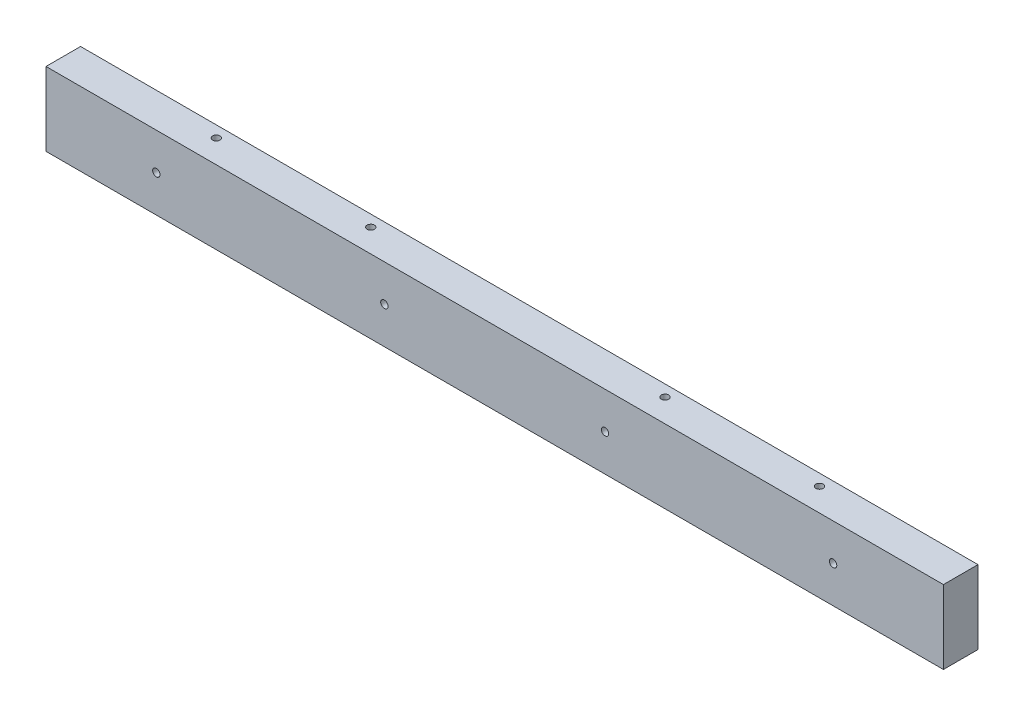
ISO-10303-21;
HEADER;
FILE_DESCRIPTION(('STEP AP214'),'2;1');
FILE_NAME('part.step','',(''),(''),'','','');
FILE_SCHEMA(('AUTOMOTIVE_DESIGN { 1 0 10303 214 1 1 1 1 }'));
ENDSEC;
DATA;
#1=APPLICATION_CONTEXT('core data for automotive mechanical design processes');
#2=APPLICATION_PROTOCOL_DEFINITION('international standard','automotive_design',2000,#1);
#3=PRODUCT_CONTEXT('',#1,'mechanical');
#4=PRODUCT('Part','Part','',(#3));
#5=PRODUCT_RELATED_PRODUCT_CATEGORY('part','',(#4));
#6=PRODUCT_DEFINITION_FORMATION('','',#4);
#7=PRODUCT_DEFINITION_CONTEXT('part definition',#1,'design');
#8=PRODUCT_DEFINITION('design','',#6,#7);
#9=PRODUCT_DEFINITION_SHAPE('','',#8);
#10=(LENGTH_UNIT() NAMED_UNIT(*) SI_UNIT(.MILLI.,.METRE.));
#11=(NAMED_UNIT(*) PLANE_ANGLE_UNIT() SI_UNIT($,.RADIAN.));
#12=(NAMED_UNIT(*) SI_UNIT($,.STERADIAN.) SOLID_ANGLE_UNIT());
#13=UNCERTAINTY_MEASURE_WITH_UNIT(LENGTH_MEASURE(1.E-05),#10,'distance_accuracy_value','');
#14=(GEOMETRIC_REPRESENTATION_CONTEXT(3) GLOBAL_UNCERTAINTY_ASSIGNED_CONTEXT((#13)) GLOBAL_UNIT_ASSIGNED_CONTEXT((#10,
#11,#12)) REPRESENTATION_CONTEXT('',''));
#15=CARTESIAN_POINT('',(0.,0.,0.));
#16=DIRECTION('',(0.,0.,1.));
#17=DIRECTION('',(1.,0.,0.));
#18=AXIS2_PLACEMENT_3D('',#15,#16,#17);
#19=CARTESIAN_POINT('',(0.,100.,0.));
#20=DIRECTION('',(1.,0.,0.));
#21=DIRECTION('',(0.,0.,-1.));
#22=AXIS2_PLACEMENT_3D('',#19,#20,#21);
#23=PLANE('',#22);
#24=DIRECTION('',(0.,0.,1.));
#25=VECTOR('',#24,1.);
#26=CARTESIAN_POINT('',(0.,0.,0.));
#27=LINE('',#26,#25);
#28=CARTESIAN_POINT('',(0.,0.,-47.));
#29=VERTEX_POINT('',#28);
#30=CARTESIAN_POINT('',(0.,0.,0.));
#31=VERTEX_POINT('',#30);
#32=EDGE_CURVE('E96',#29,#31,#27,.T.);
#33=ORIENTED_EDGE('',*,*,#32,.T.);
#34=DIRECTION('',(0.,-1.,0.));
#35=VECTOR('',#34,1.);
#36=CARTESIAN_POINT('',(0.,100.,0.));
#37=LINE('',#36,#35);
#38=CARTESIAN_POINT('',(0.,100.,0.));
#39=VERTEX_POINT('',#38);
#40=EDGE_CURVE('E11',#39,#31,#37,.T.);
#41=ORIENTED_EDGE('',*,*,#40,.F.);
#42=DIRECTION('',(0.,0.,1.));
#43=VECTOR('',#42,1.);
#44=CARTESIAN_POINT('',(0.,100.,0.));
#45=LINE('',#44,#43);
#46=CARTESIAN_POINT('',(0.,100.,-47.));
#47=VERTEX_POINT('',#46);
#48=EDGE_CURVE('E84',#47,#39,#45,.T.);
#49=ORIENTED_EDGE('',*,*,#48,.F.);
#50=DIRECTION('',(0.,-1.,0.));
#51=VECTOR('',#50,1.);
#52=CARTESIAN_POINT('',(0.,100.,-47.));
#53=LINE('',#52,#51);
#54=EDGE_CURVE('E92',#47,#29,#53,.T.);
#55=ORIENTED_EDGE('',*,*,#54,.T.);
#56=EDGE_LOOP('',(#33,#41,#49,#55));
#57=FACE_BOUND('',#56,.T.);
#58=ADVANCED_FACE('F33',(#57),#23,.F.);
#59=CARTESIAN_POINT('',(0.,100.,0.));
#60=DIRECTION('',(0.,0.,-1.));
#61=DIRECTION('',(-1.,0.,0.));
#62=AXIS2_PLACEMENT_3D('',#59,#60,#61);
#63=PLANE('',#62);
#64=CARTESIAN_POINT('',(150.,50.,0.));
#65=DIRECTION('',(0.,0.,1.));
#66=DIRECTION('',(1.,0.,0.));
#67=AXIS2_PLACEMENT_3D('',#64,#65,#66);
#68=CIRCLE('',#67,5.00000000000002);
#69=CARTESIAN_POINT('',(155.,50.,0.));
#70=VERTEX_POINT('',#69);
#71=EDGE_CURVE('E127',#70,#70,#68,.T.);
#72=ORIENTED_EDGE('',*,*,#71,.F.);
#73=EDGE_LOOP('',(#72));
#74=FACE_BOUND('',#73,.T.);
#75=CARTESIAN_POINT('',(460.,50.,0.));
#76=DIRECTION('',(0.,0.,1.));
#77=DIRECTION('',(1.,0.,0.));
#78=AXIS2_PLACEMENT_3D('',#75,#76,#77);
#79=CIRCLE('',#78,4.99999999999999);
#80=CARTESIAN_POINT('',(465.,50.,0.));
#81=VERTEX_POINT('',#80);
#82=EDGE_CURVE('E121',#81,#81,#79,.T.);
#83=ORIENTED_EDGE('',*,*,#82,.F.);
#84=EDGE_LOOP('',(#83));
#85=FACE_BOUND('',#84,.T.);
#86=CARTESIAN_POINT('',(760.,50.,0.));
#87=DIRECTION('',(0.,0.,1.));
#88=DIRECTION('',(-1.,0.,0.));
#89=AXIS2_PLACEMENT_3D('',#86,#87,#88);
#90=CIRCLE('',#89,4.99999999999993);
#91=CARTESIAN_POINT('',(755.,50.,0.));
#92=VERTEX_POINT('',#91);
#93=EDGE_CURVE('E113',#92,#92,#90,.T.);
#94=ORIENTED_EDGE('',*,*,#93,.F.);
#95=EDGE_LOOP('',(#94));
#96=FACE_BOUND('',#95,.T.);
#97=CARTESIAN_POINT('',(1070.,50.0000000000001,0.));
#98=DIRECTION('',(0.,0.,1.));
#99=DIRECTION('',(-1.,0.,0.));
#100=AXIS2_PLACEMENT_3D('',#97,#98,#99);
#101=CIRCLE('',#100,5.00000000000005);
#102=CARTESIAN_POINT('',(1065.,50.0000000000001,0.));
#103=VERTEX_POINT('',#102);
#104=EDGE_CURVE('E114',#103,#103,#101,.T.);
#105=ORIENTED_EDGE('',*,*,#104,.F.);
#106=EDGE_LOOP('',(#105));
#107=FACE_BOUND('',#106,.T.);
#108=DIRECTION('',(1.,0.,0.));
#109=VECTOR('',#108,1.);
#110=CARTESIAN_POINT('',(0.,0.,0.));
#111=LINE('',#110,#109);
#112=CARTESIAN_POINT('',(1220.,0.,0.));
#113=VERTEX_POINT('',#112);
#114=EDGE_CURVE('E88',#31,#113,#111,.T.);
#115=ORIENTED_EDGE('',*,*,#114,.T.);
#116=DIRECTION('',(0.,-1.,0.));
#117=VECTOR('',#116,1.);
#118=CARTESIAN_POINT('',(1220.,100.,0.));
#119=LINE('',#118,#117);
#120=CARTESIAN_POINT('',(1220.,100.,0.));
#121=VERTEX_POINT('',#120);
#122=EDGE_CURVE('E41',#121,#113,#119,.T.);
#123=ORIENTED_EDGE('',*,*,#122,.F.);
#124=DIRECTION('',(1.,0.,0.));
#125=VECTOR('',#124,1.);
#126=CARTESIAN_POINT('',(0.,100.,0.));
#127=LINE('',#126,#125);
#128=EDGE_CURVE('E79',#39,#121,#127,.T.);
#129=ORIENTED_EDGE('',*,*,#128,.F.);
#130=ORIENTED_EDGE('',*,*,#40,.T.);
#131=EDGE_LOOP('',(#115,#123,#129,#130));
#132=FACE_BOUND('',#131,.T.);
#133=ADVANCED_FACE('F87',(#74,#85,#96,#107,#132),#63,.F.);
#134=CARTESIAN_POINT('',(1220.,100.,0.));
#135=DIRECTION('',(-1.,0.,0.));
#136=DIRECTION('',(0.,0.,1.));
#137=AXIS2_PLACEMENT_3D('',#134,#135,#136);
#138=PLANE('',#137);
#139=DIRECTION('',(0.,0.,-1.));
#140=VECTOR('',#139,1.);
#141=CARTESIAN_POINT('',(1220.,0.,0.));
#142=LINE('',#141,#140);
#143=CARTESIAN_POINT('',(1220.,0.,-47.));
#144=VERTEX_POINT('',#143);
#145=EDGE_CURVE('E66',#113,#144,#142,.T.);
#146=ORIENTED_EDGE('',*,*,#145,.T.);
#147=DIRECTION('',(0.,-1.,0.));
#148=VECTOR('',#147,1.);
#149=CARTESIAN_POINT('',(1220.,100.,-47.));
#150=LINE('',#149,#148);
#151=CARTESIAN_POINT('',(1220.,100.,-47.));
#152=VERTEX_POINT('',#151);
#153=EDGE_CURVE('E89',#152,#144,#150,.T.);
#154=ORIENTED_EDGE('',*,*,#153,.F.);
#155=DIRECTION('',(0.,0.,-1.));
#156=VECTOR('',#155,1.);
#157=CARTESIAN_POINT('',(1220.,100.,0.));
#158=LINE('',#157,#156);
#159=EDGE_CURVE('E82',#121,#152,#158,.T.);
#160=ORIENTED_EDGE('',*,*,#159,.F.);
#161=ORIENTED_EDGE('',*,*,#122,.T.);
#162=EDGE_LOOP('',(#146,#154,#160,#161));
#163=FACE_BOUND('',#162,.T.);
#164=ADVANCED_FACE('F90',(#163),#138,.F.);
#165=CARTESIAN_POINT('',(0.,100.,-47.));
#166=DIRECTION('',(0.,0.,1.));
#167=DIRECTION('',(1.,0.,0.));
#168=AXIS2_PLACEMENT_3D('',#165,#166,#167);
#169=PLANE('',#168);
#170=CARTESIAN_POINT('',(150.,50.,-47.));
#171=DIRECTION('',(0.,0.,1.));
#172=DIRECTION('',(1.,0.,0.));
#173=AXIS2_PLACEMENT_3D('',#170,#171,#172);
#174=CIRCLE('',#173,5.00000000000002);
#175=CARTESIAN_POINT('',(155.,50.,-47.));
#176=VERTEX_POINT('',#175);
#177=EDGE_CURVE('E99',#176,#176,#174,.F.);
#178=ORIENTED_EDGE('',*,*,#177,.F.);
#179=EDGE_LOOP('',(#178));
#180=FACE_BOUND('',#179,.T.);
#181=CARTESIAN_POINT('',(460.,50.,-47.));
#182=DIRECTION('',(0.,0.,1.));
#183=DIRECTION('',(1.,0.,0.));
#184=AXIS2_PLACEMENT_3D('',#181,#182,#183);
#185=CIRCLE('',#184,4.99999999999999);
#186=CARTESIAN_POINT('',(465.,50.,-47.));
#187=VERTEX_POINT('',#186);
#188=EDGE_CURVE('E124',#187,#187,#185,.F.);
#189=ORIENTED_EDGE('',*,*,#188,.F.);
#190=EDGE_LOOP('',(#189));
#191=FACE_BOUND('',#190,.T.);
#192=CARTESIAN_POINT('',(760.,50.,-47.));
#193=DIRECTION('',(0.,0.,1.));
#194=DIRECTION('',(1.,0.,0.));
#195=AXIS2_PLACEMENT_3D('',#192,#193,#194);
#196=CIRCLE('',#195,4.99999999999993);
#197=CARTESIAN_POINT('',(765.,50.,-47.));
#198=VERTEX_POINT('',#197);
#199=EDGE_CURVE('E118',#198,#198,#196,.F.);
#200=ORIENTED_EDGE('',*,*,#199,.F.);
#201=EDGE_LOOP('',(#200));
#202=FACE_BOUND('',#201,.T.);
#203=CARTESIAN_POINT('',(1070.,50.0000000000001,-47.));
#204=DIRECTION('',(0.,0.,1.));
#205=DIRECTION('',(1.,0.,0.));
#206=AXIS2_PLACEMENT_3D('',#203,#204,#205);
#207=CIRCLE('',#206,5.00000000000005);
#208=CARTESIAN_POINT('',(1075.,50.0000000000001,-47.));
#209=VERTEX_POINT('',#208);
#210=EDGE_CURVE('E110',#209,#209,#207,.F.);
#211=ORIENTED_EDGE('',*,*,#210,.F.);
#212=EDGE_LOOP('',(#211));
#213=FACE_BOUND('',#212,.T.);
#214=DIRECTION('',(-1.,0.,0.));
#215=VECTOR('',#214,1.);
#216=CARTESIAN_POINT('',(0.,0.,-47.));
#217=LINE('',#216,#215);
#218=EDGE_CURVE('E72',#144,#29,#217,.T.);
#219=ORIENTED_EDGE('',*,*,#218,.T.);
#220=ORIENTED_EDGE('',*,*,#54,.F.);
#221=DIRECTION('',(-1.,0.,0.));
#222=VECTOR('',#221,1.);
#223=CARTESIAN_POINT('',(0.,100.,-47.));
#224=LINE('',#223,#222);
#225=EDGE_CURVE('E49',#152,#47,#224,.T.);
#226=ORIENTED_EDGE('',*,*,#225,.F.);
#227=ORIENTED_EDGE('',*,*,#153,.T.);
#228=EDGE_LOOP('',(#219,#220,#226,#227));
#229=FACE_BOUND('',#228,.T.);
#230=ADVANCED_FACE('F104',(#180,#191,#202,#213,#229),#169,.F.);
#231=CARTESIAN_POINT('',(0.,100.,0.));
#232=DIRECTION('',(0.,-1.,0.));
#233=DIRECTION('',(0.,0.,-1.));
#234=AXIS2_PLACEMENT_3D('',#231,#232,#233);
#235=PLANE('',#234);
#236=CARTESIAN_POINT('',(1020.,100.,-31.5000000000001));
#237=DIRECTION('',(0.,1.,0.));
#238=DIRECTION('',(0.,0.,1.));
#239=AXIS2_PLACEMENT_3D('',#236,#237,#238);
#240=CIRCLE('',#239,4.99999999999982);
#241=CARTESIAN_POINT('',(1020.,100.,-26.5000000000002));
#242=VERTEX_POINT('',#241);
#243=EDGE_CURVE('E117',#242,#242,#240,.T.);
#244=ORIENTED_EDGE('',*,*,#243,.F.);
#245=EDGE_LOOP('',(#244));
#246=FACE_BOUND('',#245,.T.);
#247=CARTESIAN_POINT('',(810.,100.,-31.5));
#248=DIRECTION('',(0.,1.,0.));
#249=DIRECTION('',(0.,0.,1.));
#250=AXIS2_PLACEMENT_3D('',#247,#248,#249);
#251=CIRCLE('',#250,5.00000000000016);
#252=CARTESIAN_POINT('',(810.,100.,-26.4999999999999));
#253=VERTEX_POINT('',#252);
#254=EDGE_CURVE('E149',#253,#253,#251,.T.);
#255=ORIENTED_EDGE('',*,*,#254,.F.);
#256=EDGE_LOOP('',(#255));
#257=FACE_BOUND('',#256,.T.);
#258=CARTESIAN_POINT('',(410.,100.,-31.5));
#259=DIRECTION('',(0.,1.,0.));
#260=DIRECTION('',(0.,0.,1.));
#261=AXIS2_PLACEMENT_3D('',#258,#259,#260);
#262=CIRCLE('',#261,4.99999999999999);
#263=CARTESIAN_POINT('',(410.,100.,-26.5));
#264=VERTEX_POINT('',#263);
#265=EDGE_CURVE('E143',#264,#264,#262,.T.);
#266=ORIENTED_EDGE('',*,*,#265,.F.);
#267=EDGE_LOOP('',(#266));
#268=FACE_BOUND('',#267,.T.);
#269=CARTESIAN_POINT('',(200.,100.,-31.4999999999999));
#270=DIRECTION('',(0.,1.,0.));
#271=DIRECTION('',(0.,0.,1.));
#272=AXIS2_PLACEMENT_3D('',#269,#270,#271);
#273=CIRCLE('',#272,5.00000000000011);
#274=CARTESIAN_POINT('',(200.,100.,-26.4999999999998));
#275=VERTEX_POINT('',#274);
#276=EDGE_CURVE('E137',#275,#275,#273,.T.);
#277=ORIENTED_EDGE('',*,*,#276,.F.);
#278=EDGE_LOOP('',(#277));
#279=FACE_BOUND('',#278,.T.);
#280=ORIENTED_EDGE('',*,*,#48,.T.);
#281=ORIENTED_EDGE('',*,*,#128,.T.);
#282=ORIENTED_EDGE('',*,*,#159,.T.);
#283=ORIENTED_EDGE('',*,*,#225,.T.);
#284=EDGE_LOOP('',(#280,#281,#282,#283));
#285=FACE_BOUND('',#284,.T.);
#286=ADVANCED_FACE('F80',(#246,#257,#268,#279,#285),#235,.F.);
#287=CARTESIAN_POINT('',(0.,0.,0.));
#288=DIRECTION('',(0.,-1.,0.));
#289=DIRECTION('',(0.,0.,-1.));
#290=AXIS2_PLACEMENT_3D('',#287,#288,#289);
#291=PLANE('',#290);
#292=CARTESIAN_POINT('',(1020.,0.,-31.5000000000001));
#293=DIRECTION('',(0.,-1.,0.));
#294=DIRECTION('',(0.,0.,-1.));
#295=AXIS2_PLACEMENT_3D('',#292,#293,#294);
#296=CIRCLE('',#295,4.99999999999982);
#297=CARTESIAN_POINT('',(1020.,0.,-36.4999999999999));
#298=VERTEX_POINT('',#297);
#299=EDGE_CURVE('E152',#298,#298,#296,.F.);
#300=ORIENTED_EDGE('',*,*,#299,.T.);
#301=EDGE_LOOP('',(#300));
#302=FACE_BOUND('',#301,.T.);
#303=CARTESIAN_POINT('',(810.,0.,-31.5));
#304=DIRECTION('',(0.,-1.,0.));
#305=DIRECTION('',(0.,0.,-1.));
#306=AXIS2_PLACEMENT_3D('',#303,#304,#305);
#307=CIRCLE('',#306,5.00000000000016);
#308=CARTESIAN_POINT('',(810.,0.,-36.5000000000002));
#309=VERTEX_POINT('',#308);
#310=EDGE_CURVE('E146',#309,#309,#307,.F.);
#311=ORIENTED_EDGE('',*,*,#310,.T.);
#312=EDGE_LOOP('',(#311));
#313=FACE_BOUND('',#312,.T.);
#314=CARTESIAN_POINT('',(410.,0.,-31.5));
#315=DIRECTION('',(0.,-1.,0.));
#316=DIRECTION('',(0.,0.,-1.));
#317=AXIS2_PLACEMENT_3D('',#314,#315,#316);
#318=CIRCLE('',#317,4.99999999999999);
#319=CARTESIAN_POINT('',(410.,0.,-36.5));
#320=VERTEX_POINT('',#319);
#321=EDGE_CURVE('E140',#320,#320,#318,.F.);
#322=ORIENTED_EDGE('',*,*,#321,.T.);
#323=EDGE_LOOP('',(#322));
#324=FACE_BOUND('',#323,.T.);
#325=CARTESIAN_POINT('',(200.,0.,-31.4999999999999));
#326=DIRECTION('',(0.,-1.,0.));
#327=DIRECTION('',(0.,0.,-1.));
#328=AXIS2_PLACEMENT_3D('',#325,#326,#327);
#329=CIRCLE('',#328,5.00000000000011);
#330=CARTESIAN_POINT('',(200.,0.,-36.5));
#331=VERTEX_POINT('',#330);
#332=EDGE_CURVE('E134',#331,#331,#329,.F.);
#333=ORIENTED_EDGE('',*,*,#332,.T.);
#334=EDGE_LOOP('',(#333));
#335=FACE_BOUND('',#334,.T.);
#336=ORIENTED_EDGE('',*,*,#32,.F.);
#337=ORIENTED_EDGE('',*,*,#218,.F.);
#338=ORIENTED_EDGE('',*,*,#145,.F.);
#339=ORIENTED_EDGE('',*,*,#114,.F.);
#340=EDGE_LOOP('',(#336,#337,#338,#339));
#341=FACE_BOUND('',#340,.T.);
#342=ADVANCED_FACE('F107',(#302,#313,#324,#335,#341),#291,.T.);
#343=CARTESIAN_POINT('',(1070.,50.0000000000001,-47.001));
#344=DIRECTION('',(0.,0.,1.));
#345=DIRECTION('',(1.,0.,0.));
#346=AXIS2_PLACEMENT_3D('',#343,#344,#345);
#347=CYLINDRICAL_SURFACE('',#346,5.00000000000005);
#348=ORIENTED_EDGE('',*,*,#104,.T.);
#349=EDGE_LOOP('',(#348));
#350=FACE_BOUND('',#349,.T.);
#351=ORIENTED_EDGE('',*,*,#210,.T.);
#352=EDGE_LOOP('',(#351));
#353=FACE_BOUND('',#352,.T.);
#354=ADVANCED_FACE('F202',(#350,#353),#347,.F.);
#355=CARTESIAN_POINT('',(760.,50.,-47.001));
#356=DIRECTION('',(0.,0.,1.));
#357=DIRECTION('',(1.,0.,0.));
#358=AXIS2_PLACEMENT_3D('',#355,#356,#357);
#359=CYLINDRICAL_SURFACE('',#358,4.99999999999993);
#360=ORIENTED_EDGE('',*,*,#93,.T.);
#361=EDGE_LOOP('',(#360));
#362=FACE_BOUND('',#361,.T.);
#363=ORIENTED_EDGE('',*,*,#199,.T.);
#364=EDGE_LOOP('',(#363));
#365=FACE_BOUND('',#364,.T.);
#366=ADVANCED_FACE('F207',(#362,#365),#359,.F.);
#367=CARTESIAN_POINT('',(460.,50.,-47.001));
#368=DIRECTION('',(0.,0.,1.));
#369=DIRECTION('',(1.,0.,0.));
#370=AXIS2_PLACEMENT_3D('',#367,#368,#369);
#371=CYLINDRICAL_SURFACE('',#370,4.99999999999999);
#372=ORIENTED_EDGE('',*,*,#82,.T.);
#373=EDGE_LOOP('',(#372));
#374=FACE_BOUND('',#373,.T.);
#375=ORIENTED_EDGE('',*,*,#188,.T.);
#376=EDGE_LOOP('',(#375));
#377=FACE_BOUND('',#376,.T.);
#378=ADVANCED_FACE('F182',(#374,#377),#371,.F.);
#379=CARTESIAN_POINT('',(150.,50.,-47.001));
#380=DIRECTION('',(0.,0.,1.));
#381=DIRECTION('',(1.,0.,0.));
#382=AXIS2_PLACEMENT_3D('',#379,#380,#381);
#383=CYLINDRICAL_SURFACE('',#382,5.00000000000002);
#384=ORIENTED_EDGE('',*,*,#71,.T.);
#385=EDGE_LOOP('',(#384));
#386=FACE_BOUND('',#385,.T.);
#387=ORIENTED_EDGE('',*,*,#177,.T.);
#388=EDGE_LOOP('',(#387));
#389=FACE_BOUND('',#388,.T.);
#390=ADVANCED_FACE('F172',(#386,#389),#383,.F.);
#391=CARTESIAN_POINT('',(200.,-0.001000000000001,-31.4999999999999));
#392=DIRECTION('',(0.,1.,0.));
#393=DIRECTION('',(0.,0.,1.));
#394=AXIS2_PLACEMENT_3D('',#391,#392,#393);
#395=CYLINDRICAL_SURFACE('',#394,5.00000000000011);
#396=ORIENTED_EDGE('',*,*,#332,.F.);
#397=EDGE_LOOP('',(#396));
#398=FACE_BOUND('',#397,.T.);
#399=ORIENTED_EDGE('',*,*,#276,.T.);
#400=EDGE_LOOP('',(#399));
#401=FACE_BOUND('',#400,.T.);
#402=ADVANCED_FACE('F169',(#398,#401),#395,.F.);
#403=CARTESIAN_POINT('',(410.,-0.001000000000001,-31.5));
#404=DIRECTION('',(0.,1.,0.));
#405=DIRECTION('',(0.,0.,1.));
#406=AXIS2_PLACEMENT_3D('',#403,#404,#405);
#407=CYLINDRICAL_SURFACE('',#406,4.99999999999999);
#408=ORIENTED_EDGE('',*,*,#321,.F.);
#409=EDGE_LOOP('',(#408));
#410=FACE_BOUND('',#409,.T.);
#411=ORIENTED_EDGE('',*,*,#265,.T.);
#412=EDGE_LOOP('',(#411));
#413=FACE_BOUND('',#412,.T.);
#414=ADVANCED_FACE('F171',(#410,#413),#407,.F.);
#415=CARTESIAN_POINT('',(810.,-0.001000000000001,-31.5));
#416=DIRECTION('',(0.,1.,0.));
#417=DIRECTION('',(0.,0.,1.));
#418=AXIS2_PLACEMENT_3D('',#415,#416,#417);
#419=CYLINDRICAL_SURFACE('',#418,5.00000000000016);
#420=ORIENTED_EDGE('',*,*,#310,.F.);
#421=EDGE_LOOP('',(#420));
#422=FACE_BOUND('',#421,.T.);
#423=ORIENTED_EDGE('',*,*,#254,.T.);
#424=EDGE_LOOP('',(#423));
#425=FACE_BOUND('',#424,.T.);
#426=ADVANCED_FACE('F179',(#422,#425),#419,.F.);
#427=CARTESIAN_POINT('',(1020.,-0.001000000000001,-31.5000000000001));
#428=DIRECTION('',(0.,1.,0.));
#429=DIRECTION('',(0.,0.,1.));
#430=AXIS2_PLACEMENT_3D('',#427,#428,#429);
#431=CYLINDRICAL_SURFACE('',#430,4.99999999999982);
#432=ORIENTED_EDGE('',*,*,#299,.F.);
#433=EDGE_LOOP('',(#432));
#434=FACE_BOUND('',#433,.T.);
#435=ORIENTED_EDGE('',*,*,#243,.T.);
#436=EDGE_LOOP('',(#435));
#437=FACE_BOUND('',#436,.T.);
#438=ADVANCED_FACE('F158',(#434,#437),#431,.F.);
#439=CLOSED_SHELL('',(#58,#133,#164,#230,#286,#342,#354,#366,#378,#390,#402,#414,#426,#438));
#440=MANIFOLD_SOLID_BREP('B2',#439);
#441=ADVANCED_BREP_SHAPE_REPRESENTATION('',(#18,#440),#14);
#442=SHAPE_DEFINITION_REPRESENTATION(#9,#441);
ENDSEC;
END-ISO-10303-21;
